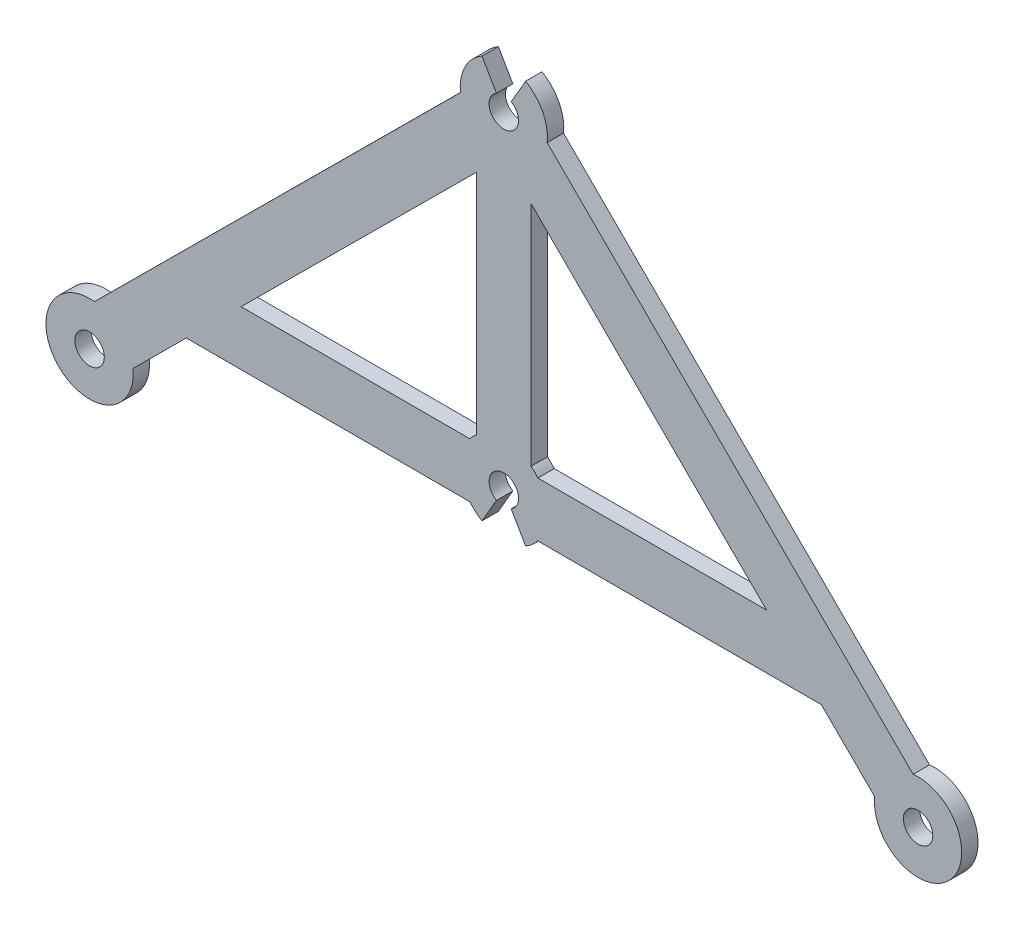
from build123d import *

# Parameters (mm, degrees)
SKETCH_1_R      = 1.35
EXTRUDE_1_DEPTH = 1.5


with BuildPart() as part:
    # Sketch 1 → Extrude 1 (new body)
    with BuildSketch(Plane.XY):
        with BuildLine():
            Line((-0.675, -1.169134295), (-2, -3.464101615))
            ThreePointArc((-2, -3.464101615), (-2.606217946, -3.034407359), (-3.122498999, -2.5))
            Line((-3.122498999, -2.5), (-29.127058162, -2.5))
            Line((-29.127058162, -2.5), (-34.023145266, -7.370318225))
            ThreePointArc((-34.023145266, -7.370318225), (-40.835880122, -10.620954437), (-37.549338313, -3.825468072))
            Line((-37.549338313, -3.825468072), (-3.976854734, 29.570318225))
            ThreePointArc((-3.976854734, 29.570318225), (-3.566663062, 31.810777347), (-2, 33.464101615))
            Line((-2, 33.464101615), (-0.675, 31.169134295))
            ThreePointArc((-0.675, 31.169134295), (0, 28.65), (0.675, 31.169134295))
            Line((0.675, 31.169134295), (2, 33.464101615))
            ThreePointArc((2, 33.464101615), (3.566663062, 31.810777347), (3.976854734, 29.570318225))
            Line((3.976854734, 29.570318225), (37.549338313, -3.825468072))
            ThreePointArc((37.549338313, -3.825468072), (40.835880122, -10.620954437), (34.023145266, -7.370318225))
            Line((34.023145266, -7.370318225), (29.127058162, -2.5))
            Line((29.127058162, -2.5), (3.122498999, -2.5))
            ThreePointArc((3.122498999, -2.5), (2.606217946, -3.034407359), (2, -3.464101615))
            Line((2, -3.464101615), (0.675, -1.169134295))
            ThreePointArc((0.675, -1.169134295), (0, 1.35), (-0.675, -1.169134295))
        make_face()
        with Locations((-38, -7.8)):
            Circle(SKETCH_1_R, mode=Mode.SUBTRACT)
        with Locations((38, -7.8)):
            Circle(SKETCH_1_R, mode=Mode.SUBTRACT)
        with BuildLine():
            Line((2.5, 3.122498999), (2.5, 23.986915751))
            Line((2.5, 23.986915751), (24.100603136, 2.5))
            Line((24.100603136, 2.5), (3.122498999, 2.5))
            ThreePointArc((3.122498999, 2.5), (2.828427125, 2.828427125), (2.5, 3.122498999))
        make_face(mode=Mode.SUBTRACT)
        with BuildLine():
            Line((-2.5, 23.986915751), (-2.5, 3.122498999))
            ThreePointArc((-2.5, 3.122498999), (-2.828427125, 2.828427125), (-3.122498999, 2.5))
            Line((-3.122498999, 2.5), (-24.100603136, 2.5))
            Line((-24.100603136, 2.5), (-2.5, 23.986915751))
        make_face(mode=Mode.SUBTRACT)
    extrude(amount=EXTRUDE_1_DEPTH)


solid = part.part
